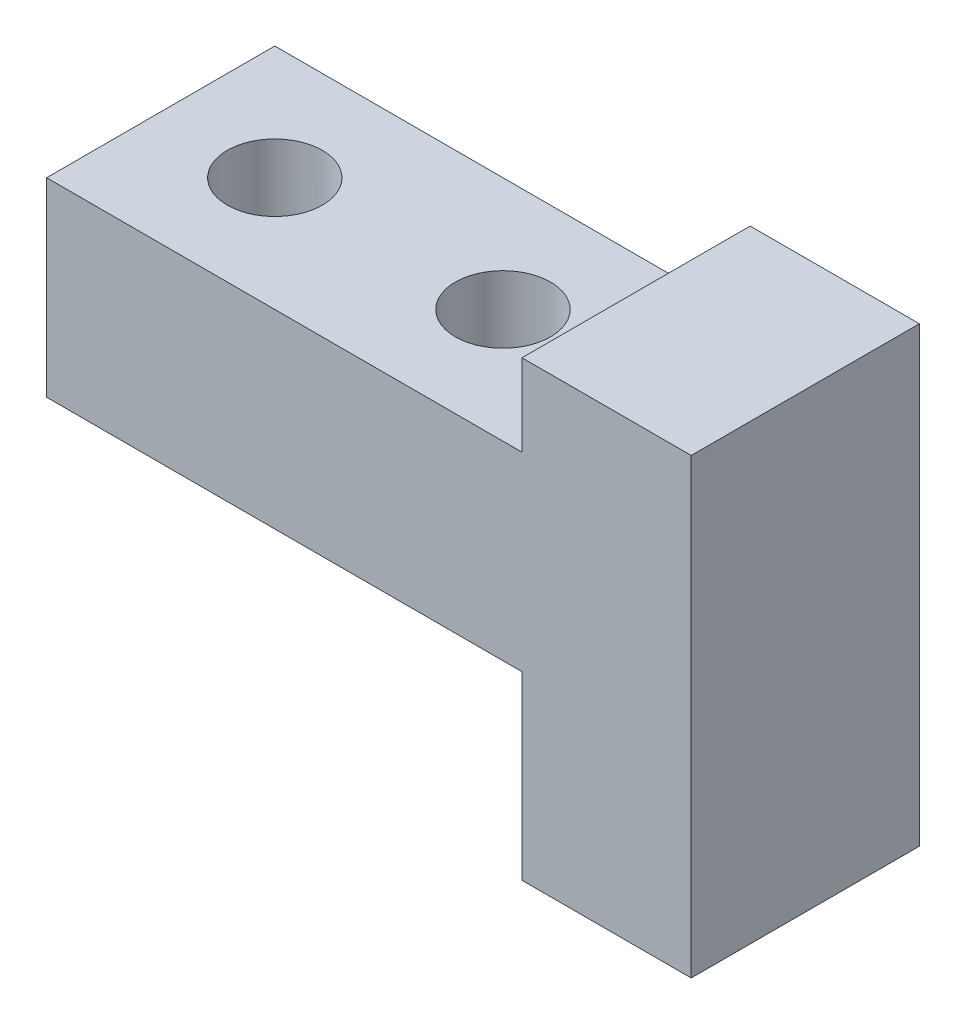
ISO-10303-21;
HEADER;
FILE_DESCRIPTION(('STEP AP214'),'2;1');
FILE_NAME('part.step','',(''),(''),'','','');
FILE_SCHEMA(('AUTOMOTIVE_DESIGN { 1 0 10303 214 1 1 1 1 }'));
ENDSEC;
DATA;
#1=APPLICATION_CONTEXT('core data for automotive mechanical design processes');
#2=APPLICATION_PROTOCOL_DEFINITION('international standard','automotive_design',2000,#1);
#3=PRODUCT_CONTEXT('',#1,'mechanical');
#4=PRODUCT('Part','Part','',(#3));
#5=PRODUCT_RELATED_PRODUCT_CATEGORY('part','',(#4));
#6=PRODUCT_DEFINITION_FORMATION('','',#4);
#7=PRODUCT_DEFINITION_CONTEXT('part definition',#1,'design');
#8=PRODUCT_DEFINITION('design','',#6,#7);
#9=PRODUCT_DEFINITION_SHAPE('','',#8);
#10=(LENGTH_UNIT() NAMED_UNIT(*) SI_UNIT(.MILLI.,.METRE.));
#11=(NAMED_UNIT(*) PLANE_ANGLE_UNIT() SI_UNIT($,.RADIAN.));
#12=(NAMED_UNIT(*) SI_UNIT($,.STERADIAN.) SOLID_ANGLE_UNIT());
#13=UNCERTAINTY_MEASURE_WITH_UNIT(LENGTH_MEASURE(1.E-05),#10,'distance_accuracy_value','');
#14=(GEOMETRIC_REPRESENTATION_CONTEXT(3) GLOBAL_UNCERTAINTY_ASSIGNED_CONTEXT((#13)) GLOBAL_UNIT_ASSIGNED_CONTEXT((#10,
#11,#12)) REPRESENTATION_CONTEXT('',''));
#15=CARTESIAN_POINT('',(0.,0.,0.));
#16=DIRECTION('',(0.,0.,1.));
#17=DIRECTION('',(1.,0.,0.));
#18=AXIS2_PLACEMENT_3D('',#15,#16,#17);
#19=CARTESIAN_POINT('',(-8.9,10.,6.));
#20=DIRECTION('',(1.,0.,0.));
#21=DIRECTION('',(0.,0.,-1.));
#22=AXIS2_PLACEMENT_3D('',#19,#20,#21);
#23=PLANE('',#22);
#24=DIRECTION('',(0.,-1.,0.));
#25=VECTOR('',#24,1.);
#26=CARTESIAN_POINT('',(-8.9,10.,-6.));
#27=LINE('',#26,#25);
#28=CARTESIAN_POINT('',(-8.9,14.3,-6.));
#29=VERTEX_POINT('',#28);
#30=CARTESIAN_POINT('',(-8.9,10.,-6.));
#31=VERTEX_POINT('',#30);
#32=EDGE_CURVE('E114',#29,#31,#27,.T.);
#33=ORIENTED_EDGE('',*,*,#32,.T.);
#34=DIRECTION('',(0.,0.,-1.));
#35=VECTOR('',#34,1.);
#36=CARTESIAN_POINT('',(-8.9,10.,6.));
#37=LINE('',#36,#35);
#38=CARTESIAN_POINT('',(-8.9,10.,6.));
#39=VERTEX_POINT('',#38);
#40=EDGE_CURVE('E11',#39,#31,#37,.T.);
#41=ORIENTED_EDGE('',*,*,#40,.F.);
#42=DIRECTION('',(0.,-1.,0.));
#43=VECTOR('',#42,1.);
#44=CARTESIAN_POINT('',(-8.9,10.,6.));
#45=LINE('',#44,#43);
#46=CARTESIAN_POINT('',(-8.9,14.3,6.));
#47=VERTEX_POINT('',#46);
#48=EDGE_CURVE('E129',#47,#39,#45,.T.);
#49=ORIENTED_EDGE('',*,*,#48,.F.);
#50=DIRECTION('',(0.,0.,-1.));
#51=VECTOR('',#50,1.);
#52=CARTESIAN_POINT('',(-8.9,14.3,6.));
#53=LINE('',#52,#51);
#54=EDGE_CURVE('E110',#47,#29,#53,.T.);
#55=ORIENTED_EDGE('',*,*,#54,.T.);
#56=EDGE_LOOP('',(#33,#41,#49,#55));
#57=FACE_BOUND('',#56,.T.);
#58=ADVANCED_FACE('F16',(#57),#23,.F.);
#59=CARTESIAN_POINT('',(-33.9,10.,6.));
#60=DIRECTION('',(0.,-1.,0.));
#61=DIRECTION('',(0.,0.,-1.));
#62=AXIS2_PLACEMENT_3D('',#59,#60,#61);
#63=PLANE('',#62);
#64=CARTESIAN_POINT('',(-15.9,10.,0.));
#65=DIRECTION('',(0.,1.,0.));
#66=DIRECTION('',(0.,0.,1.));
#67=AXIS2_PLACEMENT_3D('',#64,#65,#66);
#68=CIRCLE('',#67,2.5);
#69=CARTESIAN_POINT('',(-15.9,10.,2.5));
#70=VERTEX_POINT('',#69);
#71=EDGE_CURVE('E149',#70,#70,#68,.T.);
#72=ORIENTED_EDGE('',*,*,#71,.F.);
#73=EDGE_LOOP('',(#72));
#74=FACE_BOUND('',#73,.T.);
#75=CARTESIAN_POINT('',(-27.9,10.,0.));
#76=DIRECTION('',(0.,1.,0.));
#77=DIRECTION('',(0.,0.,1.));
#78=AXIS2_PLACEMENT_3D('',#75,#76,#77);
#79=CIRCLE('',#78,2.5);
#80=CARTESIAN_POINT('',(-27.9,10.,2.5));
#81=VERTEX_POINT('',#80);
#82=EDGE_CURVE('E141',#81,#81,#79,.T.);
#83=ORIENTED_EDGE('',*,*,#82,.F.);
#84=EDGE_LOOP('',(#83));
#85=FACE_BOUND('',#84,.T.);
#86=DIRECTION('',(-1.,0.,0.));
#87=VECTOR('',#86,1.);
#88=CARTESIAN_POINT('',(-33.9,10.,-6.));
#89=LINE('',#88,#87);
#90=CARTESIAN_POINT('',(-33.9,10.,-6.));
#91=VERTEX_POINT('',#90);
#92=EDGE_CURVE('E117',#31,#91,#89,.T.);
#93=ORIENTED_EDGE('',*,*,#92,.T.);
#94=DIRECTION('',(0.,0.,-1.));
#95=VECTOR('',#94,1.);
#96=CARTESIAN_POINT('',(-33.9,10.,6.));
#97=LINE('',#96,#95);
#98=CARTESIAN_POINT('',(-33.9,10.,6.));
#99=VERTEX_POINT('',#98);
#100=EDGE_CURVE('E25',#99,#91,#97,.T.);
#101=ORIENTED_EDGE('',*,*,#100,.F.);
#102=DIRECTION('',(-1.,0.,0.));
#103=VECTOR('',#102,1.);
#104=CARTESIAN_POINT('',(-33.9,10.,6.));
#105=LINE('',#104,#103);
#106=EDGE_CURVE('E77',#39,#99,#105,.T.);
#107=ORIENTED_EDGE('',*,*,#106,.F.);
#108=ORIENTED_EDGE('',*,*,#40,.T.);
#109=EDGE_LOOP('',(#93,#101,#107,#108));
#110=FACE_BOUND('',#109,.T.);
#111=ADVANCED_FACE('F186',(#74,#85,#110),#63,.F.);
#112=CARTESIAN_POINT('',(-33.9,0.,6.));
#113=DIRECTION('',(1.,0.,0.));
#114=DIRECTION('',(0.,0.,-1.));
#115=AXIS2_PLACEMENT_3D('',#112,#113,#114);
#116=PLANE('',#115);
#117=DIRECTION('',(0.,-1.,0.));
#118=VECTOR('',#117,1.);
#119=CARTESIAN_POINT('',(-33.9,0.,-6.));
#120=LINE('',#119,#118);
#121=CARTESIAN_POINT('',(-33.9,0.,-6.));
#122=VERTEX_POINT('',#121);
#123=EDGE_CURVE('E120',#91,#122,#120,.T.);
#124=ORIENTED_EDGE('',*,*,#123,.T.);
#125=DIRECTION('',(0.,0.,-1.));
#126=VECTOR('',#125,1.);
#127=CARTESIAN_POINT('',(-33.9,0.,6.));
#128=LINE('',#127,#126);
#129=CARTESIAN_POINT('',(-33.9,0.,6.));
#130=VERTEX_POINT('',#129);
#131=EDGE_CURVE('E136',#130,#122,#128,.T.);
#132=ORIENTED_EDGE('',*,*,#131,.F.);
#133=DIRECTION('',(0.,-1.,0.));
#134=VECTOR('',#133,1.);
#135=CARTESIAN_POINT('',(-33.9,0.,6.));
#136=LINE('',#135,#134);
#137=EDGE_CURVE('E154',#99,#130,#136,.T.);
#138=ORIENTED_EDGE('',*,*,#137,.F.);
#139=ORIENTED_EDGE('',*,*,#100,.T.);
#140=EDGE_LOOP('',(#124,#132,#138,#139));
#141=FACE_BOUND('',#140,.T.);
#142=ADVANCED_FACE('F190',(#141),#116,.F.);
#143=CARTESIAN_POINT('',(-8.9,0.,6.));
#144=DIRECTION('',(0.,1.,0.));
#145=DIRECTION('',(-1.,0.,0.));
#146=AXIS2_PLACEMENT_3D('',#143,#144,#145);
#147=PLANE('',#146);
#148=CARTESIAN_POINT('',(-15.9,0.,0.));
#149=DIRECTION('',(0.,1.,0.));
#150=DIRECTION('',(-1.,0.,0.));
#151=AXIS2_PLACEMENT_3D('',#148,#149,#150);
#152=CIRCLE('',#151,2.5);
#153=CARTESIAN_POINT('',(-18.4,0.,0.));
#154=VERTEX_POINT('',#153);
#155=EDGE_CURVE('E19',#154,#154,#152,.T.);
#156=ORIENTED_EDGE('',*,*,#155,.T.);
#157=EDGE_LOOP('',(#156));
#158=FACE_BOUND('',#157,.T.);
#159=CARTESIAN_POINT('',(-27.9,0.,0.));
#160=DIRECTION('',(0.,1.,0.));
#161=DIRECTION('',(-1.,0.,0.));
#162=AXIS2_PLACEMENT_3D('',#159,#160,#161);
#163=CIRCLE('',#162,2.5);
#164=CARTESIAN_POINT('',(-30.4,0.,0.));
#165=VERTEX_POINT('',#164);
#166=EDGE_CURVE('E118',#165,#165,#163,.T.);
#167=ORIENTED_EDGE('',*,*,#166,.T.);
#168=EDGE_LOOP('',(#167));
#169=FACE_BOUND('',#168,.T.);
#170=DIRECTION('',(1.,0.,0.));
#171=VECTOR('',#170,1.);
#172=CARTESIAN_POINT('',(-8.9,0.,-6.));
#173=LINE('',#172,#171);
#174=CARTESIAN_POINT('',(-8.9,0.,-6.));
#175=VERTEX_POINT('',#174);
#176=EDGE_CURVE('E122',#122,#175,#173,.T.);
#177=ORIENTED_EDGE('',*,*,#176,.T.);
#178=DIRECTION('',(0.,0.,-1.));
#179=VECTOR('',#178,1.);
#180=CARTESIAN_POINT('',(-8.9,0.,6.));
#181=LINE('',#180,#179);
#182=CARTESIAN_POINT('',(-8.9,0.,6.));
#183=VERTEX_POINT('',#182);
#184=EDGE_CURVE('E133',#183,#175,#181,.T.);
#185=ORIENTED_EDGE('',*,*,#184,.F.);
#186=DIRECTION('',(1.,0.,0.));
#187=VECTOR('',#186,1.);
#188=CARTESIAN_POINT('',(-8.9,0.,6.));
#189=LINE('',#188,#187);
#190=EDGE_CURVE('E156',#130,#183,#189,.T.);
#191=ORIENTED_EDGE('',*,*,#190,.F.);
#192=ORIENTED_EDGE('',*,*,#131,.T.);
#193=EDGE_LOOP('',(#177,#185,#191,#192));
#194=FACE_BOUND('',#193,.T.);
#195=ADVANCED_FACE('F162',(#158,#169,#194),#147,.F.);
#196=CARTESIAN_POINT('',(-8.9,-9.50000000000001,6.));
#197=DIRECTION('',(1.,0.,0.));
#198=DIRECTION('',(0.,0.,-1.));
#199=AXIS2_PLACEMENT_3D('',#196,#197,#198);
#200=PLANE('',#199);
#201=DIRECTION('',(0.,-1.,0.));
#202=VECTOR('',#201,1.);
#203=CARTESIAN_POINT('',(-8.9,-9.50000000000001,-6.));
#204=LINE('',#203,#202);
#205=CARTESIAN_POINT('',(-8.9,-9.50000000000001,-6.));
#206=VERTEX_POINT('',#205);
#207=EDGE_CURVE('E124',#175,#206,#204,.T.);
#208=ORIENTED_EDGE('',*,*,#207,.T.);
#209=DIRECTION('',(0.,0.,-1.));
#210=VECTOR('',#209,1.);
#211=CARTESIAN_POINT('',(-8.9,-9.50000000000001,6.));
#212=LINE('',#211,#210);
#213=CARTESIAN_POINT('',(-8.9,-9.50000000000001,6.));
#214=VERTEX_POINT('',#213);
#215=EDGE_CURVE('E105',#214,#206,#212,.T.);
#216=ORIENTED_EDGE('',*,*,#215,.F.);
#217=DIRECTION('',(0.,-1.,0.));
#218=VECTOR('',#217,1.);
#219=CARTESIAN_POINT('',(-8.9,-9.50000000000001,6.));
#220=LINE('',#219,#218);
#221=EDGE_CURVE('E96',#183,#214,#220,.T.);
#222=ORIENTED_EDGE('',*,*,#221,.F.);
#223=ORIENTED_EDGE('',*,*,#184,.T.);
#224=EDGE_LOOP('',(#208,#216,#222,#223));
#225=FACE_BOUND('',#224,.T.);
#226=ADVANCED_FACE('F166',(#225),#200,.F.);
#227=CARTESIAN_POINT('',(0.,-9.50000000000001,6.));
#228=DIRECTION('',(0.,1.,0.));
#229=DIRECTION('',(0.,0.,1.));
#230=AXIS2_PLACEMENT_3D('',#227,#228,#229);
#231=PLANE('',#230);
#232=DIRECTION('',(1.,0.,0.));
#233=VECTOR('',#232,1.);
#234=CARTESIAN_POINT('',(0.,-9.50000000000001,-6.));
#235=LINE('',#234,#233);
#236=CARTESIAN_POINT('',(0.,-9.50000000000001,-6.));
#237=VERTEX_POINT('',#236);
#238=EDGE_CURVE('E104',#206,#237,#235,.T.);
#239=ORIENTED_EDGE('',*,*,#238,.T.);
#240=DIRECTION('',(0.,0.,-1.));
#241=VECTOR('',#240,1.);
#242=CARTESIAN_POINT('',(0.,-9.50000000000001,6.));
#243=LINE('',#242,#241);
#244=CARTESIAN_POINT('',(0.,-9.50000000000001,6.));
#245=VERTEX_POINT('',#244);
#246=EDGE_CURVE('E101',#245,#237,#243,.T.);
#247=ORIENTED_EDGE('',*,*,#246,.F.);
#248=DIRECTION('',(1.,0.,0.));
#249=VECTOR('',#248,1.);
#250=CARTESIAN_POINT('',(0.,-9.50000000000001,6.));
#251=LINE('',#250,#249);
#252=EDGE_CURVE('E90',#214,#245,#251,.T.);
#253=ORIENTED_EDGE('',*,*,#252,.F.);
#254=ORIENTED_EDGE('',*,*,#215,.T.);
#255=EDGE_LOOP('',(#239,#247,#253,#254));
#256=FACE_BOUND('',#255,.T.);
#257=ADVANCED_FACE('F102',(#256),#231,.F.);
#258=CARTESIAN_POINT('',(0.,14.3,6.));
#259=DIRECTION('',(-1.,0.,0.));
#260=DIRECTION('',(0.,-1.,0.));
#261=AXIS2_PLACEMENT_3D('',#258,#259,#260);
#262=PLANE('',#261);
#263=DIRECTION('',(0.,1.,0.));
#264=VECTOR('',#263,1.);
#265=CARTESIAN_POINT('',(0.,14.3,-6.));
#266=LINE('',#265,#264);
#267=CARTESIAN_POINT('',(0.,14.3,-6.));
#268=VERTEX_POINT('',#267);
#269=EDGE_CURVE('E63',#237,#268,#266,.T.);
#270=ORIENTED_EDGE('',*,*,#269,.T.);
#271=DIRECTION('',(0.,0.,-1.));
#272=VECTOR('',#271,1.);
#273=CARTESIAN_POINT('',(0.,14.3,6.));
#274=LINE('',#273,#272);
#275=CARTESIAN_POINT('',(0.,14.3,6.));
#276=VERTEX_POINT('',#275);
#277=EDGE_CURVE('E106',#276,#268,#274,.T.);
#278=ORIENTED_EDGE('',*,*,#277,.F.);
#279=DIRECTION('',(0.,1.,0.));
#280=VECTOR('',#279,1.);
#281=CARTESIAN_POINT('',(0.,14.3,6.));
#282=LINE('',#281,#280);
#283=EDGE_CURVE('E94',#245,#276,#282,.T.);
#284=ORIENTED_EDGE('',*,*,#283,.F.);
#285=ORIENTED_EDGE('',*,*,#246,.T.);
#286=EDGE_LOOP('',(#270,#278,#284,#285));
#287=FACE_BOUND('',#286,.T.);
#288=ADVANCED_FACE('F108',(#287),#262,.F.);
#289=CARTESIAN_POINT('',(-8.9,14.3,6.));
#290=DIRECTION('',(0.,-1.,0.));
#291=DIRECTION('',(0.,0.,-1.));
#292=AXIS2_PLACEMENT_3D('',#289,#290,#291);
#293=PLANE('',#292);
#294=DIRECTION('',(-1.,0.,0.));
#295=VECTOR('',#294,1.);
#296=CARTESIAN_POINT('',(-8.9,14.3,-6.));
#297=LINE('',#296,#295);
#298=EDGE_CURVE('E69',#268,#29,#297,.T.);
#299=ORIENTED_EDGE('',*,*,#298,.T.);
#300=ORIENTED_EDGE('',*,*,#54,.F.);
#301=DIRECTION('',(-1.,0.,0.));
#302=VECTOR('',#301,1.);
#303=CARTESIAN_POINT('',(-8.9,14.3,6.));
#304=LINE('',#303,#302);
#305=EDGE_CURVE('E34',#276,#47,#304,.T.);
#306=ORIENTED_EDGE('',*,*,#305,.F.);
#307=ORIENTED_EDGE('',*,*,#277,.T.);
#308=EDGE_LOOP('',(#299,#300,#306,#307));
#309=FACE_BOUND('',#308,.T.);
#310=ADVANCED_FACE('F174',(#309),#293,.F.);
#311=CARTESIAN_POINT('',(-8.9,14.3,6.));
#312=DIRECTION('',(0.,0.,-1.));
#313=DIRECTION('',(-1.,0.,0.));
#314=AXIS2_PLACEMENT_3D('',#311,#312,#313);
#315=PLANE('',#314);
#316=ORIENTED_EDGE('',*,*,#48,.T.);
#317=ORIENTED_EDGE('',*,*,#106,.T.);
#318=ORIENTED_EDGE('',*,*,#137,.T.);
#319=ORIENTED_EDGE('',*,*,#190,.T.);
#320=ORIENTED_EDGE('',*,*,#221,.T.);
#321=ORIENTED_EDGE('',*,*,#252,.T.);
#322=ORIENTED_EDGE('',*,*,#283,.T.);
#323=ORIENTED_EDGE('',*,*,#305,.T.);
#324=EDGE_LOOP('',(#316,#317,#318,#319,#320,#321,#322,#323));
#325=FACE_BOUND('',#324,.T.);
#326=ADVANCED_FACE('F92',(#325),#315,.F.);
#327=CARTESIAN_POINT('',(-8.9,14.3,-6.));
#328=DIRECTION('',(0.,0.,-1.));
#329=DIRECTION('',(-1.,0.,0.));
#330=AXIS2_PLACEMENT_3D('',#327,#328,#329);
#331=PLANE('',#330);
#332=ORIENTED_EDGE('',*,*,#32,.F.);
#333=ORIENTED_EDGE('',*,*,#298,.F.);
#334=ORIENTED_EDGE('',*,*,#269,.F.);
#335=ORIENTED_EDGE('',*,*,#238,.F.);
#336=ORIENTED_EDGE('',*,*,#207,.F.);
#337=ORIENTED_EDGE('',*,*,#176,.F.);
#338=ORIENTED_EDGE('',*,*,#123,.F.);
#339=ORIENTED_EDGE('',*,*,#92,.F.);
#340=EDGE_LOOP('',(#332,#333,#334,#335,#336,#337,#338,#339));
#341=FACE_BOUND('',#340,.T.);
#342=ADVANCED_FACE('F169',(#341),#331,.T.);
#343=CARTESIAN_POINT('',(-27.9,-9.50000000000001,0.));
#344=DIRECTION('',(0.,1.,0.));
#345=DIRECTION('',(0.,0.,1.));
#346=AXIS2_PLACEMENT_3D('',#343,#344,#345);
#347=CYLINDRICAL_SURFACE('',#346,2.5);
#348=ORIENTED_EDGE('',*,*,#82,.T.);
#349=EDGE_LOOP('',(#348));
#350=FACE_BOUND('',#349,.T.);
#351=ORIENTED_EDGE('',*,*,#166,.F.);
#352=EDGE_LOOP('',(#351));
#353=FACE_BOUND('',#352,.T.);
#354=ADVANCED_FACE('F241',(#350,#353),#347,.F.);
#355=CARTESIAN_POINT('',(-15.9,-9.50000000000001,0.));
#356=DIRECTION('',(0.,1.,0.));
#357=DIRECTION('',(0.,0.,1.));
#358=AXIS2_PLACEMENT_3D('',#355,#356,#357);
#359=CYLINDRICAL_SURFACE('',#358,2.5);
#360=ORIENTED_EDGE('',*,*,#71,.T.);
#361=EDGE_LOOP('',(#360));
#362=FACE_BOUND('',#361,.T.);
#363=ORIENTED_EDGE('',*,*,#155,.F.);
#364=EDGE_LOOP('',(#363));
#365=FACE_BOUND('',#364,.T.);
#366=ADVANCED_FACE('F249',(#362,#365),#359,.F.);
#367=CLOSED_SHELL('',(#58,#111,#142,#195,#226,#257,#288,#310,#326,#342,#354,#366));
#368=MANIFOLD_SOLID_BREP('B1',#367);
#369=ADVANCED_BREP_SHAPE_REPRESENTATION('',(#18,#368),#14);
#370=SHAPE_DEFINITION_REPRESENTATION(#9,#369);
ENDSEC;
END-ISO-10303-21;
